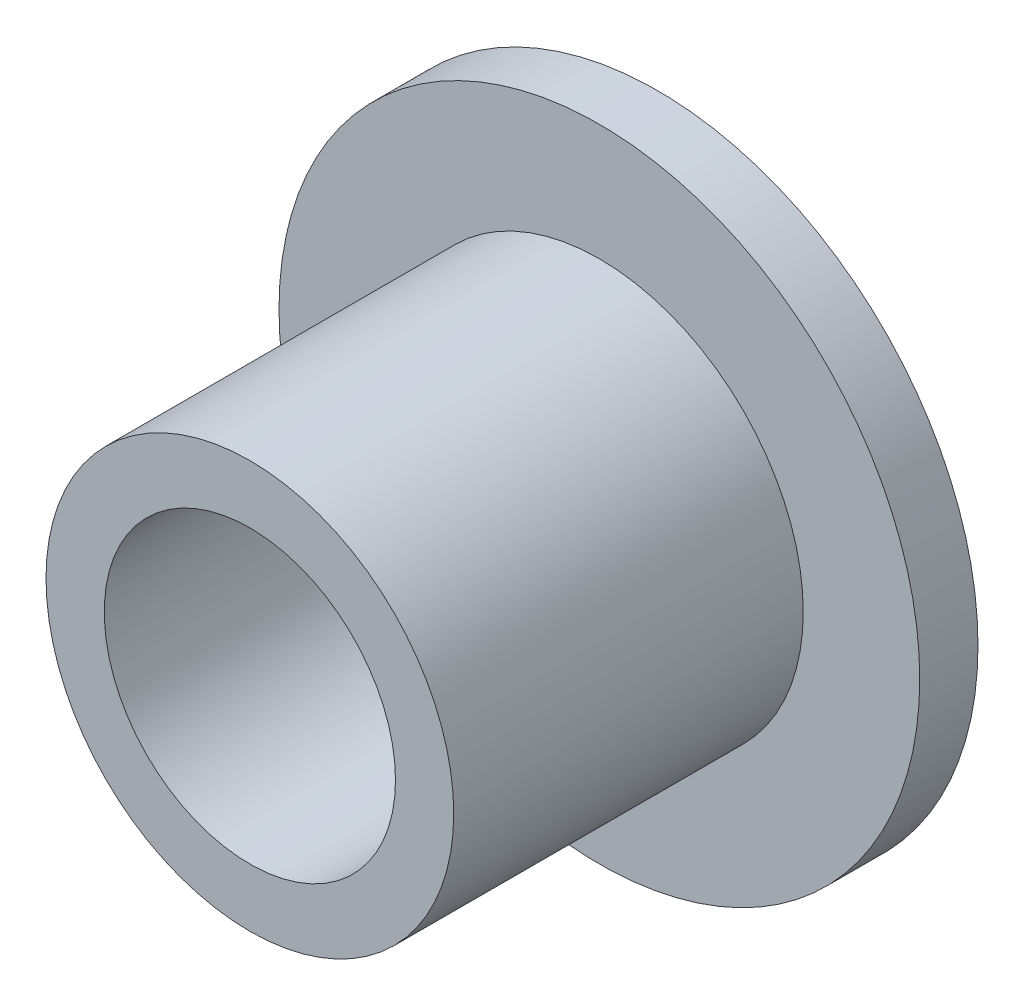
ISO-10303-21;
HEADER;
FILE_DESCRIPTION(('STEP AP214'),'2;1');
FILE_NAME('part.step','',(''),(''),'','','');
FILE_SCHEMA(('AUTOMOTIVE_DESIGN { 1 0 10303 214 1 1 1 1 }'));
ENDSEC;
DATA;
#1=APPLICATION_CONTEXT('core data for automotive mechanical design processes');
#2=APPLICATION_PROTOCOL_DEFINITION('international standard','automotive_design',2000,#1);
#3=PRODUCT_CONTEXT('',#1,'mechanical');
#4=PRODUCT('Part','Part','',(#3));
#5=PRODUCT_RELATED_PRODUCT_CATEGORY('part','',(#4));
#6=PRODUCT_DEFINITION_FORMATION('','',#4);
#7=PRODUCT_DEFINITION_CONTEXT('part definition',#1,'design');
#8=PRODUCT_DEFINITION('design','',#6,#7);
#9=PRODUCT_DEFINITION_SHAPE('','',#8);
#10=(LENGTH_UNIT() NAMED_UNIT(*) SI_UNIT(.MILLI.,.METRE.));
#11=(NAMED_UNIT(*) PLANE_ANGLE_UNIT() SI_UNIT($,.RADIAN.));
#12=(NAMED_UNIT(*) SI_UNIT($,.STERADIAN.) SOLID_ANGLE_UNIT());
#13=UNCERTAINTY_MEASURE_WITH_UNIT(LENGTH_MEASURE(1.E-05),#10,'distance_accuracy_value','');
#14=(GEOMETRIC_REPRESENTATION_CONTEXT(3) GLOBAL_UNCERTAINTY_ASSIGNED_CONTEXT((#13)) GLOBAL_UNIT_ASSIGNED_CONTEXT((#10,
#11,#12)) REPRESENTATION_CONTEXT('',''));
#15=CARTESIAN_POINT('',(0.,0.,0.));
#16=DIRECTION('',(0.,0.,1.));
#17=DIRECTION('',(1.,0.,0.));
#18=AXIS2_PLACEMENT_3D('',#15,#16,#17);
#19=CARTESIAN_POINT('',(0.,3.5,0.));
#20=DIRECTION('',(0.,0.,-1.));
#21=DIRECTION('',(-1.,0.,0.));
#22=AXIS2_PLACEMENT_3D('',#19,#20,#21);
#23=PLANE('',#22);
#24=CARTESIAN_POINT('',(0.,0.,0.));
#25=DIRECTION('',(0.,0.,1.));
#26=DIRECTION('',(1.,0.,0.));
#27=AXIS2_PLACEMENT_3D('',#24,#25,#26);
#28=CIRCLE('',#27,2.5);
#29=CARTESIAN_POINT('',(2.5,0.,0.));
#30=VERTEX_POINT('',#29);
#31=EDGE_CURVE('E10',#30,#30,#28,.T.);
#32=ORIENTED_EDGE('',*,*,#31,.F.);
#33=EDGE_LOOP('',(#32));
#34=FACE_BOUND('',#33,.T.);
#35=CARTESIAN_POINT('',(0.,0.,0.));
#36=DIRECTION('',(0.,0.,1.));
#37=DIRECTION('',(1.,0.,0.));
#38=AXIS2_PLACEMENT_3D('',#35,#36,#37);
#39=CIRCLE('',#38,3.5);
#40=CARTESIAN_POINT('',(3.5,0.,0.));
#41=VERTEX_POINT('',#40);
#42=EDGE_CURVE('E53',#41,#41,#39,.T.);
#43=ORIENTED_EDGE('',*,*,#42,.T.);
#44=EDGE_LOOP('',(#43));
#45=FACE_BOUND('',#44,.T.);
#46=ADVANCED_FACE('F31',(#34,#45),#23,.F.);
#47=CARTESIAN_POINT('',(0.,0.,0.));
#48=DIRECTION('',(0.,0.,1.));
#49=DIRECTION('',(1.,0.,0.));
#50=AXIS2_PLACEMENT_3D('',#47,#48,#49);
#51=CYLINDRICAL_SURFACE('',#50,2.5);
#52=CARTESIAN_POINT('',(0.,0.,-7.));
#53=DIRECTION('',(0.,0.,1.));
#54=DIRECTION('',(1.,0.,0.));
#55=AXIS2_PLACEMENT_3D('',#52,#53,#54);
#56=CIRCLE('',#55,2.5);
#57=CARTESIAN_POINT('',(2.5,0.,-7.));
#58=VERTEX_POINT('',#57);
#59=EDGE_CURVE('E37',#58,#58,#56,.T.);
#60=ORIENTED_EDGE('',*,*,#59,.F.);
#61=EDGE_LOOP('',(#60));
#62=FACE_BOUND('',#61,.T.);
#63=ORIENTED_EDGE('',*,*,#31,.T.);
#64=EDGE_LOOP('',(#63));
#65=FACE_BOUND('',#64,.T.);
#66=ADVANCED_FACE('F78',(#62,#65),#51,.F.);
#67=CARTESIAN_POINT('',(0.,2.5,-7.));
#68=DIRECTION('',(0.,0.,1.));
#69=DIRECTION('',(1.,0.,0.));
#70=AXIS2_PLACEMENT_3D('',#67,#68,#69);
#71=PLANE('',#70);
#72=CARTESIAN_POINT('',(0.,0.,-7.));
#73=DIRECTION('',(0.,0.,1.));
#74=DIRECTION('',(1.,0.,0.));
#75=AXIS2_PLACEMENT_3D('',#72,#73,#74);
#76=CIRCLE('',#75,5.5);
#77=CARTESIAN_POINT('',(5.5,0.,-7.));
#78=VERTEX_POINT('',#77);
#79=EDGE_CURVE('E41',#78,#78,#76,.T.);
#80=ORIENTED_EDGE('',*,*,#79,.F.);
#81=EDGE_LOOP('',(#80));
#82=FACE_BOUND('',#81,.T.);
#83=ORIENTED_EDGE('',*,*,#59,.T.);
#84=EDGE_LOOP('',(#83));
#85=FACE_BOUND('',#84,.T.);
#86=ADVANCED_FACE('F73',(#82,#85),#71,.F.);
#87=CARTESIAN_POINT('',(0.,0.,0.));
#88=DIRECTION('',(0.,0.,1.));
#89=DIRECTION('',(1.,0.,0.));
#90=AXIS2_PLACEMENT_3D('',#87,#88,#89);
#91=CYLINDRICAL_SURFACE('',#90,5.5);
#92=CARTESIAN_POINT('',(0.,0.,-6.));
#93=DIRECTION('',(0.,0.,1.));
#94=DIRECTION('',(1.,0.,0.));
#95=AXIS2_PLACEMENT_3D('',#92,#93,#94);
#96=CIRCLE('',#95,5.5);
#97=CARTESIAN_POINT('',(5.5,0.,-6.));
#98=VERTEX_POINT('',#97);
#99=EDGE_CURVE('E45',#98,#98,#96,.T.);
#100=ORIENTED_EDGE('',*,*,#99,.F.);
#101=EDGE_LOOP('',(#100));
#102=FACE_BOUND('',#101,.T.);
#103=ORIENTED_EDGE('',*,*,#79,.T.);
#104=EDGE_LOOP('',(#103));
#105=FACE_BOUND('',#104,.T.);
#106=ADVANCED_FACE('F67',(#102,#105),#91,.T.);
#107=CARTESIAN_POINT('',(0.,5.5,-6.));
#108=DIRECTION('',(0.,0.,-1.));
#109=DIRECTION('',(-1.,0.,0.));
#110=AXIS2_PLACEMENT_3D('',#107,#108,#109);
#111=PLANE('',#110);
#112=CARTESIAN_POINT('',(0.,0.,-6.));
#113=DIRECTION('',(0.,0.,1.));
#114=DIRECTION('',(1.,0.,0.));
#115=AXIS2_PLACEMENT_3D('',#112,#113,#114);
#116=CIRCLE('',#115,3.5);
#117=CARTESIAN_POINT('',(3.5,0.,-6.));
#118=VERTEX_POINT('',#117);
#119=EDGE_CURVE('E50',#118,#118,#116,.T.);
#120=ORIENTED_EDGE('',*,*,#119,.F.);
#121=EDGE_LOOP('',(#120));
#122=FACE_BOUND('',#121,.T.);
#123=ORIENTED_EDGE('',*,*,#99,.T.);
#124=EDGE_LOOP('',(#123));
#125=FACE_BOUND('',#124,.T.);
#126=ADVANCED_FACE('F61',(#122,#125),#111,.F.);
#127=CARTESIAN_POINT('',(0.,0.,0.));
#128=DIRECTION('',(0.,0.,1.));
#129=DIRECTION('',(1.,0.,0.));
#130=AXIS2_PLACEMENT_3D('',#127,#128,#129);
#131=CYLINDRICAL_SURFACE('',#130,3.5);
#132=ORIENTED_EDGE('',*,*,#42,.F.);
#133=EDGE_LOOP('',(#132));
#134=FACE_BOUND('',#133,.T.);
#135=ORIENTED_EDGE('',*,*,#119,.T.);
#136=EDGE_LOOP('',(#135));
#137=FACE_BOUND('',#136,.T.);
#138=ADVANCED_FACE('F58',(#134,#137),#131,.T.);
#139=CLOSED_SHELL('',(#46,#66,#86,#106,#126,#138));
#140=MANIFOLD_SOLID_BREP('B2',#139);
#141=ADVANCED_BREP_SHAPE_REPRESENTATION('',(#18,#140),#14);
#142=SHAPE_DEFINITION_REPRESENTATION(#9,#141);
ENDSEC;
END-ISO-10303-21;
